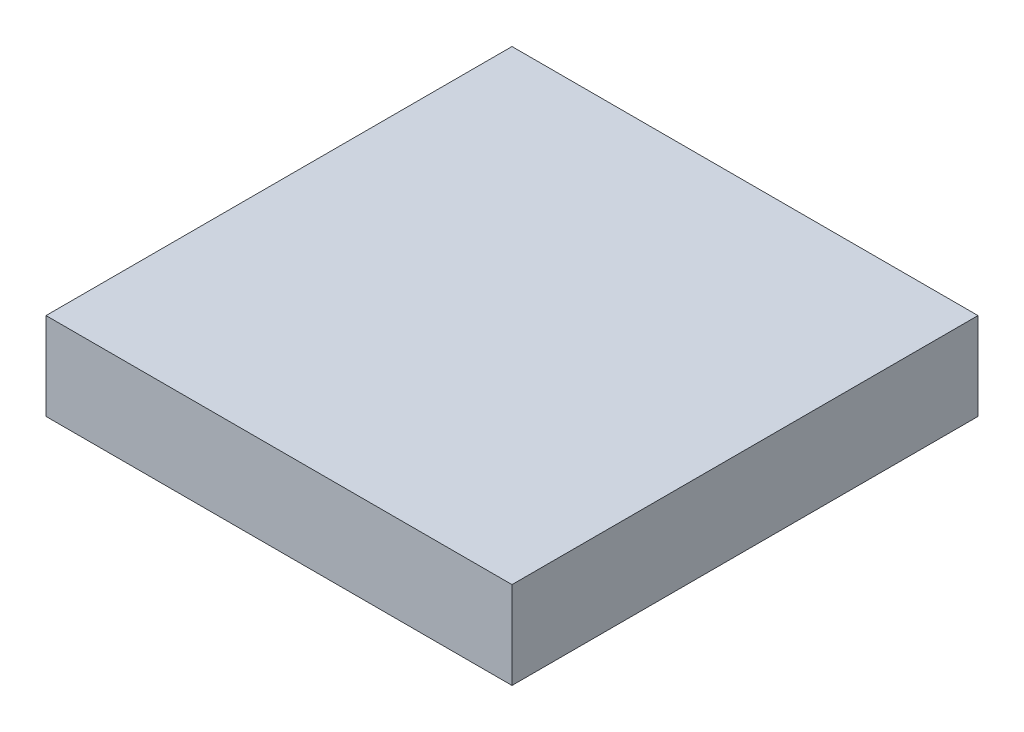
ISO-10303-21;
HEADER;
FILE_DESCRIPTION(('STEP AP214'),'2;1');
FILE_NAME('part.step','',(''),(''),'','','');
FILE_SCHEMA(('AUTOMOTIVE_DESIGN { 1 0 10303 214 1 1 1 1 }'));
ENDSEC;
DATA;
#1=APPLICATION_CONTEXT('core data for automotive mechanical design processes');
#2=APPLICATION_PROTOCOL_DEFINITION('international standard','automotive_design',2000,#1);
#3=PRODUCT_CONTEXT('',#1,'mechanical');
#4=PRODUCT('Part','Part','',(#3));
#5=PRODUCT_RELATED_PRODUCT_CATEGORY('part','',(#4));
#6=PRODUCT_DEFINITION_FORMATION('','',#4);
#7=PRODUCT_DEFINITION_CONTEXT('part definition',#1,'design');
#8=PRODUCT_DEFINITION('design','',#6,#7);
#9=PRODUCT_DEFINITION_SHAPE('','',#8);
#10=(LENGTH_UNIT() NAMED_UNIT(*) SI_UNIT(.MILLI.,.METRE.));
#11=(NAMED_UNIT(*) PLANE_ANGLE_UNIT() SI_UNIT($,.RADIAN.));
#12=(NAMED_UNIT(*) SI_UNIT($,.STERADIAN.) SOLID_ANGLE_UNIT());
#13=UNCERTAINTY_MEASURE_WITH_UNIT(LENGTH_MEASURE(1.E-05),#10,'distance_accuracy_value','');
#14=(GEOMETRIC_REPRESENTATION_CONTEXT(3) GLOBAL_UNCERTAINTY_ASSIGNED_CONTEXT((#13)) GLOBAL_UNIT_ASSIGNED_CONTEXT((#10,
#11,#12)) REPRESENTATION_CONTEXT('',''));
#15=CARTESIAN_POINT('',(0.,0.,0.));
#16=DIRECTION('',(0.,0.,1.));
#17=DIRECTION('',(1.,0.,0.));
#18=AXIS2_PLACEMENT_3D('',#15,#16,#17);
#19=CARTESIAN_POINT('',(0.,3.,0.));
#20=DIRECTION('',(1.,0.,0.));
#21=DIRECTION('',(0.,0.,-1.));
#22=AXIS2_PLACEMENT_3D('',#19,#20,#21);
#23=PLANE('',#22);
#24=DIRECTION('',(0.,0.,1.));
#25=VECTOR('',#24,1.);
#26=CARTESIAN_POINT('',(0.,0.,0.));
#27=LINE('',#26,#25);
#28=CARTESIAN_POINT('',(0.,0.,0.));
#29=VERTEX_POINT('',#28);
#30=CARTESIAN_POINT('',(0.,0.,16.));
#31=VERTEX_POINT('',#30);
#32=EDGE_CURVE('E95',#29,#31,#27,.T.);
#33=ORIENTED_EDGE('',*,*,#32,.T.);
#34=DIRECTION('',(0.,-1.,0.));
#35=VECTOR('',#34,1.);
#36=CARTESIAN_POINT('',(0.,3.,16.));
#37=LINE('',#36,#35);
#38=CARTESIAN_POINT('',(0.,3.,16.));
#39=VERTEX_POINT('',#38);
#40=EDGE_CURVE('E11',#39,#31,#37,.T.);
#41=ORIENTED_EDGE('',*,*,#40,.F.);
#42=DIRECTION('',(0.,0.,1.));
#43=VECTOR('',#42,1.);
#44=CARTESIAN_POINT('',(0.,3.,0.));
#45=LINE('',#44,#43);
#46=CARTESIAN_POINT('',(0.,3.,0.));
#47=VERTEX_POINT('',#46);
#48=EDGE_CURVE('E83',#47,#39,#45,.T.);
#49=ORIENTED_EDGE('',*,*,#48,.F.);
#50=DIRECTION('',(0.,-1.,0.));
#51=VECTOR('',#50,1.);
#52=CARTESIAN_POINT('',(0.,3.,0.));
#53=LINE('',#52,#51);
#54=EDGE_CURVE('E91',#47,#29,#53,.T.);
#55=ORIENTED_EDGE('',*,*,#54,.T.);
#56=EDGE_LOOP('',(#33,#41,#49,#55));
#57=FACE_BOUND('',#56,.T.);
#58=ADVANCED_FACE('F32',(#57),#23,.F.);
#59=CARTESIAN_POINT('',(0.,3.,16.));
#60=DIRECTION('',(0.,0.,-1.));
#61=DIRECTION('',(-1.,0.,0.));
#62=AXIS2_PLACEMENT_3D('',#59,#60,#61);
#63=PLANE('',#62);
#64=DIRECTION('',(1.,0.,0.));
#65=VECTOR('',#64,1.);
#66=CARTESIAN_POINT('',(0.,0.,16.));
#67=LINE('',#66,#65);
#68=CARTESIAN_POINT('',(16.,0.,16.));
#69=VERTEX_POINT('',#68);
#70=EDGE_CURVE('E87',#31,#69,#67,.T.);
#71=ORIENTED_EDGE('',*,*,#70,.T.);
#72=DIRECTION('',(0.,-1.,0.));
#73=VECTOR('',#72,1.);
#74=CARTESIAN_POINT('',(16.,3.,16.));
#75=LINE('',#74,#73);
#76=CARTESIAN_POINT('',(16.,3.,16.));
#77=VERTEX_POINT('',#76);
#78=EDGE_CURVE('E40',#77,#69,#75,.T.);
#79=ORIENTED_EDGE('',*,*,#78,.F.);
#80=DIRECTION('',(1.,0.,0.));
#81=VECTOR('',#80,1.);
#82=CARTESIAN_POINT('',(0.,3.,16.));
#83=LINE('',#82,#81);
#84=EDGE_CURVE('E78',#39,#77,#83,.T.);
#85=ORIENTED_EDGE('',*,*,#84,.F.);
#86=ORIENTED_EDGE('',*,*,#40,.T.);
#87=EDGE_LOOP('',(#71,#79,#85,#86));
#88=FACE_BOUND('',#87,.T.);
#89=ADVANCED_FACE('F86',(#88),#63,.F.);
#90=CARTESIAN_POINT('',(16.,3.,0.));
#91=DIRECTION('',(-1.,0.,0.));
#92=DIRECTION('',(0.,0.,1.));
#93=AXIS2_PLACEMENT_3D('',#90,#91,#92);
#94=PLANE('',#93);
#95=DIRECTION('',(0.,0.,-1.));
#96=VECTOR('',#95,1.);
#97=CARTESIAN_POINT('',(16.,0.,0.));
#98=LINE('',#97,#96);
#99=CARTESIAN_POINT('',(16.,0.,0.));
#100=VERTEX_POINT('',#99);
#101=EDGE_CURVE('E65',#69,#100,#98,.T.);
#102=ORIENTED_EDGE('',*,*,#101,.T.);
#103=DIRECTION('',(0.,-1.,0.));
#104=VECTOR('',#103,1.);
#105=CARTESIAN_POINT('',(16.,3.,0.));
#106=LINE('',#105,#104);
#107=CARTESIAN_POINT('',(16.,3.,0.));
#108=VERTEX_POINT('',#107);
#109=EDGE_CURVE('E88',#108,#100,#106,.T.);
#110=ORIENTED_EDGE('',*,*,#109,.F.);
#111=DIRECTION('',(0.,0.,-1.));
#112=VECTOR('',#111,1.);
#113=CARTESIAN_POINT('',(16.,3.,0.));
#114=LINE('',#113,#112);
#115=EDGE_CURVE('E81',#77,#108,#114,.T.);
#116=ORIENTED_EDGE('',*,*,#115,.F.);
#117=ORIENTED_EDGE('',*,*,#78,.T.);
#118=EDGE_LOOP('',(#102,#110,#116,#117));
#119=FACE_BOUND('',#118,.T.);
#120=ADVANCED_FACE('F89',(#119),#94,.F.);
#121=CARTESIAN_POINT('',(0.,3.,0.));
#122=DIRECTION('',(0.,0.,1.));
#123=DIRECTION('',(1.,0.,0.));
#124=AXIS2_PLACEMENT_3D('',#121,#122,#123);
#125=PLANE('',#124);
#126=DIRECTION('',(-1.,0.,0.));
#127=VECTOR('',#126,1.);
#128=CARTESIAN_POINT('',(0.,0.,0.));
#129=LINE('',#128,#127);
#130=EDGE_CURVE('E71',#100,#29,#129,.T.);
#131=ORIENTED_EDGE('',*,*,#130,.T.);
#132=ORIENTED_EDGE('',*,*,#54,.F.);
#133=DIRECTION('',(-1.,0.,0.));
#134=VECTOR('',#133,1.);
#135=CARTESIAN_POINT('',(0.,3.,0.));
#136=LINE('',#135,#134);
#137=EDGE_CURVE('E48',#108,#47,#136,.T.);
#138=ORIENTED_EDGE('',*,*,#137,.F.);
#139=ORIENTED_EDGE('',*,*,#109,.T.);
#140=EDGE_LOOP('',(#131,#132,#138,#139));
#141=FACE_BOUND('',#140,.T.);
#142=ADVANCED_FACE('F102',(#141),#125,.F.);
#143=CARTESIAN_POINT('',(0.,3.,0.));
#144=DIRECTION('',(0.,1.,0.));
#145=DIRECTION('',(0.,0.,1.));
#146=AXIS2_PLACEMENT_3D('',#143,#144,#145);
#147=PLANE('',#146);
#148=ORIENTED_EDGE('',*,*,#48,.T.);
#149=ORIENTED_EDGE('',*,*,#84,.T.);
#150=ORIENTED_EDGE('',*,*,#115,.T.);
#151=ORIENTED_EDGE('',*,*,#137,.T.);
#152=EDGE_LOOP('',(#148,#149,#150,#151));
#153=FACE_BOUND('',#152,.T.);
#154=ADVANCED_FACE('F79',(#153),#147,.T.);
#155=CARTESIAN_POINT('',(0.,0.,0.));
#156=DIRECTION('',(0.,1.,0.));
#157=DIRECTION('',(0.,0.,1.));
#158=AXIS2_PLACEMENT_3D('',#155,#156,#157);
#159=PLANE('',#158);
#160=ORIENTED_EDGE('',*,*,#32,.F.);
#161=ORIENTED_EDGE('',*,*,#130,.F.);
#162=ORIENTED_EDGE('',*,*,#101,.F.);
#163=ORIENTED_EDGE('',*,*,#70,.F.);
#164=EDGE_LOOP('',(#160,#161,#162,#163));
#165=FACE_BOUND('',#164,.T.);
#166=ADVANCED_FACE('F105',(#165),#159,.F.);
#167=CLOSED_SHELL('',(#58,#89,#120,#142,#154,#166));
#168=MANIFOLD_SOLID_BREP('B2',#167);
#169=ADVANCED_BREP_SHAPE_REPRESENTATION('',(#18,#168),#14);
#170=SHAPE_DEFINITION_REPRESENTATION(#9,#169);
ENDSEC;
END-ISO-10303-21;
